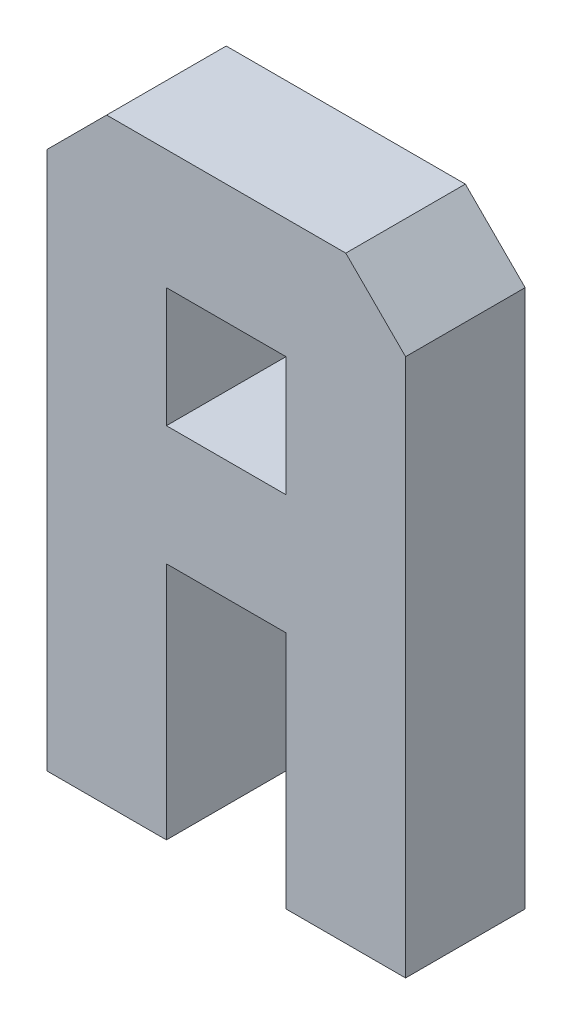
ISO-10303-21;
HEADER;
FILE_DESCRIPTION(('STEP AP214'),'2;1');
FILE_NAME('part.step','',(''),(''),'','','');
FILE_SCHEMA(('AUTOMOTIVE_DESIGN { 1 0 10303 214 1 1 1 1 }'));
ENDSEC;
DATA;
#1=APPLICATION_CONTEXT('core data for automotive mechanical design processes');
#2=APPLICATION_PROTOCOL_DEFINITION('international standard','automotive_design',2000,#1);
#3=PRODUCT_CONTEXT('',#1,'mechanical');
#4=PRODUCT('Part','Part','',(#3));
#5=PRODUCT_RELATED_PRODUCT_CATEGORY('part','',(#4));
#6=PRODUCT_DEFINITION_FORMATION('','',#4);
#7=PRODUCT_DEFINITION_CONTEXT('part definition',#1,'design');
#8=PRODUCT_DEFINITION('design','',#6,#7);
#9=PRODUCT_DEFINITION_SHAPE('','',#8);
#10=(LENGTH_UNIT() NAMED_UNIT(*) SI_UNIT(.MILLI.,.METRE.));
#11=(NAMED_UNIT(*) PLANE_ANGLE_UNIT() SI_UNIT($,.RADIAN.));
#12=(NAMED_UNIT(*) SI_UNIT($,.STERADIAN.) SOLID_ANGLE_UNIT());
#13=UNCERTAINTY_MEASURE_WITH_UNIT(LENGTH_MEASURE(1.E-05),#10,'distance_accuracy_value','');
#14=(GEOMETRIC_REPRESENTATION_CONTEXT(3) GLOBAL_UNCERTAINTY_ASSIGNED_CONTEXT((#13)) GLOBAL_UNIT_ASSIGNED_CONTEXT((#10,
#11,#12)) REPRESENTATION_CONTEXT('',''));
#15=CARTESIAN_POINT('',(0.,0.,0.));
#16=DIRECTION('',(0.,0.,1.));
#17=DIRECTION('',(1.,0.,0.));
#18=AXIS2_PLACEMENT_3D('',#15,#16,#17);
#19=CARTESIAN_POINT('',(0.,0.,10.));
#20=DIRECTION('',(0.,0.,-1.));
#21=DIRECTION('',(-1.,0.,0.));
#22=AXIS2_PLACEMENT_3D('',#19,#20,#21);
#23=PLANE('',#22);
#24=DIRECTION('',(-1.,0.,0.));
#25=VECTOR('',#24,1.);
#26=CARTESIAN_POINT('',(0.,50.,10.));
#27=LINE('',#26,#25);
#28=CARTESIAN_POINT('',(25.,50.,10.));
#29=VERTEX_POINT('',#28);
#30=CARTESIAN_POINT('',(5.00000000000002,50.,10.));
#31=VERTEX_POINT('',#30);
#32=EDGE_CURVE('E192',#29,#31,#27,.T.);
#33=ORIENTED_EDGE('',*,*,#32,.T.);
#34=DIRECTION('',(0.707106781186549,0.707106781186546,0.));
#35=VECTOR('',#34,1.);
#36=CARTESIAN_POINT('',(0.,45.,10.));
#37=LINE('',#36,#35);
#38=CARTESIAN_POINT('',(0.,45.,10.));
#39=VERTEX_POINT('',#38);
#40=EDGE_CURVE('E41',#31,#39,#37,.F.);
#41=ORIENTED_EDGE('',*,*,#40,.T.);
#42=DIRECTION('',(0.,-1.,0.));
#43=VECTOR('',#42,1.);
#44=CARTESIAN_POINT('',(0.,0.,10.));
#45=LINE('',#44,#43);
#46=CARTESIAN_POINT('',(0.,0.,10.));
#47=VERTEX_POINT('',#46);
#48=EDGE_CURVE('E194',#39,#47,#45,.T.);
#49=ORIENTED_EDGE('',*,*,#48,.T.);
#50=DIRECTION('',(1.,0.,0.));
#51=VECTOR('',#50,1.);
#52=CARTESIAN_POINT('',(10.,0.,10.));
#53=LINE('',#52,#51);
#54=CARTESIAN_POINT('',(10.,0.,10.));
#55=VERTEX_POINT('',#54);
#56=EDGE_CURVE('E178',#47,#55,#53,.T.);
#57=ORIENTED_EDGE('',*,*,#56,.T.);
#58=DIRECTION('',(0.,1.,0.));
#59=VECTOR('',#58,1.);
#60=CARTESIAN_POINT('',(10.,20.,10.));
#61=LINE('',#60,#59);
#62=CARTESIAN_POINT('',(10.,20.,10.));
#63=VERTEX_POINT('',#62);
#64=EDGE_CURVE('E181',#55,#63,#61,.T.);
#65=ORIENTED_EDGE('',*,*,#64,.T.);
#66=DIRECTION('',(1.,0.,0.));
#67=VECTOR('',#66,1.);
#68=CARTESIAN_POINT('',(20.,20.,10.));
#69=LINE('',#68,#67);
#70=CARTESIAN_POINT('',(20.,20.,10.));
#71=VERTEX_POINT('',#70);
#72=EDGE_CURVE('E184',#63,#71,#69,.T.);
#73=ORIENTED_EDGE('',*,*,#72,.T.);
#74=DIRECTION('',(0.,-1.,0.));
#75=VECTOR('',#74,1.);
#76=CARTESIAN_POINT('',(20.,0.,10.));
#77=LINE('',#76,#75);
#78=CARTESIAN_POINT('',(20.,0.,10.));
#79=VERTEX_POINT('',#78);
#80=EDGE_CURVE('E186',#71,#79,#77,.T.);
#81=ORIENTED_EDGE('',*,*,#80,.T.);
#82=DIRECTION('',(1.,0.,0.));
#83=VECTOR('',#82,1.);
#84=CARTESIAN_POINT('',(30.,0.,10.));
#85=LINE('',#84,#83);
#86=CARTESIAN_POINT('',(30.,0.,10.));
#87=VERTEX_POINT('',#86);
#88=EDGE_CURVE('E188',#79,#87,#85,.T.);
#89=ORIENTED_EDGE('',*,*,#88,.T.);
#90=DIRECTION('',(0.,1.,0.));
#91=VECTOR('',#90,1.);
#92=CARTESIAN_POINT('',(30.,50.,10.));
#93=LINE('',#92,#91);
#94=CARTESIAN_POINT('',(30.,45.,10.));
#95=VERTEX_POINT('',#94);
#96=EDGE_CURVE('E190',#87,#95,#93,.T.);
#97=ORIENTED_EDGE('',*,*,#96,.T.);
#98=DIRECTION('',(0.707106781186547,-0.707106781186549,0.));
#99=VECTOR('',#98,1.);
#100=CARTESIAN_POINT('',(25.,50.,10.));
#101=LINE('',#100,#99);
#102=EDGE_CURVE('E240',#95,#29,#101,.F.);
#103=ORIENTED_EDGE('',*,*,#102,.T.);
#104=EDGE_LOOP('',(#33,#41,#49,#57,#65,#73,#81,#89,#97,#103));
#105=FACE_BOUND('',#104,.T.);
#106=DIRECTION('',(0.,-1.,0.));
#107=VECTOR('',#106,1.);
#108=CARTESIAN_POINT('',(10.,40.,10.));
#109=LINE('',#108,#107);
#110=CARTESIAN_POINT('',(10.,40.,10.));
#111=VERTEX_POINT('',#110);
#112=CARTESIAN_POINT('',(10.,30.,10.));
#113=VERTEX_POINT('',#112);
#114=EDGE_CURVE('E137',#111,#113,#109,.T.);
#115=ORIENTED_EDGE('',*,*,#114,.F.);
#116=DIRECTION('',(-1.,0.,0.));
#117=VECTOR('',#116,1.);
#118=CARTESIAN_POINT('',(10.,40.,10.));
#119=LINE('',#118,#117);
#120=CARTESIAN_POINT('',(20.,40.,10.));
#121=VERTEX_POINT('',#120);
#122=EDGE_CURVE('E162',#121,#111,#119,.T.);
#123=ORIENTED_EDGE('',*,*,#122,.F.);
#124=DIRECTION('',(0.,1.,0.));
#125=VECTOR('',#124,1.);
#126=CARTESIAN_POINT('',(20.,40.,10.));
#127=LINE('',#126,#125);
#128=CARTESIAN_POINT('',(20.,30.,10.));
#129=VERTEX_POINT('',#128);
#130=EDGE_CURVE('E160',#129,#121,#127,.T.);
#131=ORIENTED_EDGE('',*,*,#130,.F.);
#132=DIRECTION('',(1.,0.,0.));
#133=VECTOR('',#132,1.);
#134=CARTESIAN_POINT('',(10.,30.,10.));
#135=LINE('',#134,#133);
#136=EDGE_CURVE('E147',#113,#129,#135,.T.);
#137=ORIENTED_EDGE('',*,*,#136,.F.);
#138=EDGE_LOOP('',(#115,#123,#131,#137));
#139=FACE_BOUND('',#138,.T.);
#140=ADVANCED_FACE('F33',(#105,#139),#23,.F.);
#141=CARTESIAN_POINT('',(0.,0.,0.));
#142=DIRECTION('',(0.,0.,-1.));
#143=DIRECTION('',(-1.,0.,0.));
#144=AXIS2_PLACEMENT_3D('',#141,#142,#143);
#145=PLANE('',#144);
#146=DIRECTION('',(0.,-1.,0.));
#147=VECTOR('',#146,1.);
#148=CARTESIAN_POINT('',(0.,0.,0.));
#149=LINE('',#148,#147);
#150=CARTESIAN_POINT('',(0.,45.,0.));
#151=VERTEX_POINT('',#150);
#152=CARTESIAN_POINT('',(0.,0.,0.));
#153=VERTEX_POINT('',#152);
#154=EDGE_CURVE('E182',#151,#153,#149,.T.);
#155=ORIENTED_EDGE('',*,*,#154,.F.);
#156=DIRECTION('',(-0.707106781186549,-0.707106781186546,0.));
#157=VECTOR('',#156,1.);
#158=CARTESIAN_POINT('',(-22.5,22.5000000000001,0.));
#159=LINE('',#158,#157);
#160=CARTESIAN_POINT('',(5.00000000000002,50.,0.));
#161=VERTEX_POINT('',#160);
#162=EDGE_CURVE('E234',#151,#161,#159,.F.);
#163=ORIENTED_EDGE('',*,*,#162,.T.);
#164=DIRECTION('',(-1.,0.,0.));
#165=VECTOR('',#164,1.);
#166=CARTESIAN_POINT('',(0.,50.,0.));
#167=LINE('',#166,#165);
#168=CARTESIAN_POINT('',(25.,50.,0.));
#169=VERTEX_POINT('',#168);
#170=EDGE_CURVE('E209',#169,#161,#167,.T.);
#171=ORIENTED_EDGE('',*,*,#170,.F.);
#172=DIRECTION('',(-0.707106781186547,0.707106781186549,0.));
#173=VECTOR('',#172,1.);
#174=CARTESIAN_POINT('',(37.5,37.4999999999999,0.));
#175=LINE('',#174,#173);
#176=CARTESIAN_POINT('',(30.,45.,0.));
#177=VERTEX_POINT('',#176);
#178=EDGE_CURVE('E232',#169,#177,#175,.F.);
#179=ORIENTED_EDGE('',*,*,#178,.T.);
#180=DIRECTION('',(0.,1.,0.));
#181=VECTOR('',#180,1.);
#182=CARTESIAN_POINT('',(30.,50.,0.));
#183=LINE('',#182,#181);
#184=CARTESIAN_POINT('',(30.,0.,0.));
#185=VERTEX_POINT('',#184);
#186=EDGE_CURVE('E207',#185,#177,#183,.T.);
#187=ORIENTED_EDGE('',*,*,#186,.F.);
#188=DIRECTION('',(1.,0.,0.));
#189=VECTOR('',#188,1.);
#190=CARTESIAN_POINT('',(30.,0.,0.));
#191=LINE('',#190,#189);
#192=CARTESIAN_POINT('',(20.,0.,0.));
#193=VERTEX_POINT('',#192);
#194=EDGE_CURVE('E205',#193,#185,#191,.T.);
#195=ORIENTED_EDGE('',*,*,#194,.F.);
#196=DIRECTION('',(0.,-1.,0.));
#197=VECTOR('',#196,1.);
#198=CARTESIAN_POINT('',(20.,0.,0.));
#199=LINE('',#198,#197);
#200=CARTESIAN_POINT('',(20.,20.,0.));
#201=VERTEX_POINT('',#200);
#202=EDGE_CURVE('E203',#201,#193,#199,.T.);
#203=ORIENTED_EDGE('',*,*,#202,.F.);
#204=DIRECTION('',(1.,0.,0.));
#205=VECTOR('',#204,1.);
#206=CARTESIAN_POINT('',(20.,20.,0.));
#207=LINE('',#206,#205);
#208=CARTESIAN_POINT('',(10.,20.,0.));
#209=VERTEX_POINT('',#208);
#210=EDGE_CURVE('E201',#209,#201,#207,.T.);
#211=ORIENTED_EDGE('',*,*,#210,.F.);
#212=DIRECTION('',(0.,1.,0.));
#213=VECTOR('',#212,1.);
#214=CARTESIAN_POINT('',(10.,20.,0.));
#215=LINE('',#214,#213);
#216=CARTESIAN_POINT('',(10.,0.,0.));
#217=VERTEX_POINT('',#216);
#218=EDGE_CURVE('E199',#217,#209,#215,.T.);
#219=ORIENTED_EDGE('',*,*,#218,.F.);
#220=DIRECTION('',(1.,0.,0.));
#221=VECTOR('',#220,1.);
#222=CARTESIAN_POINT('',(10.,0.,0.));
#223=LINE('',#222,#221);
#224=EDGE_CURVE('E155',#153,#217,#223,.T.);
#225=ORIENTED_EDGE('',*,*,#224,.F.);
#226=EDGE_LOOP('',(#155,#163,#171,#179,#187,#195,#203,#211,#219,#225));
#227=FACE_BOUND('',#226,.T.);
#228=DIRECTION('',(-1.,0.,0.));
#229=VECTOR('',#228,1.);
#230=CARTESIAN_POINT('',(10.,40.,0.));
#231=LINE('',#230,#229);
#232=CARTESIAN_POINT('',(20.,40.,0.));
#233=VERTEX_POINT('',#232);
#234=CARTESIAN_POINT('',(10.,40.,0.));
#235=VERTEX_POINT('',#234);
#236=EDGE_CURVE('E148',#233,#235,#231,.T.);
#237=ORIENTED_EDGE('',*,*,#236,.T.);
#238=DIRECTION('',(0.,-1.,0.));
#239=VECTOR('',#238,1.);
#240=CARTESIAN_POINT('',(10.,40.,0.));
#241=LINE('',#240,#239);
#242=CARTESIAN_POINT('',(10.,30.,0.));
#243=VERTEX_POINT('',#242);
#244=EDGE_CURVE('E166',#235,#243,#241,.T.);
#245=ORIENTED_EDGE('',*,*,#244,.T.);
#246=DIRECTION('',(1.,0.,0.));
#247=VECTOR('',#246,1.);
#248=CARTESIAN_POINT('',(10.,30.,0.));
#249=LINE('',#248,#247);
#250=CARTESIAN_POINT('',(20.,30.,0.));
#251=VERTEX_POINT('',#250);
#252=EDGE_CURVE('E154',#243,#251,#249,.T.);
#253=ORIENTED_EDGE('',*,*,#252,.T.);
#254=DIRECTION('',(0.,1.,0.));
#255=VECTOR('',#254,1.);
#256=CARTESIAN_POINT('',(20.,40.,0.));
#257=LINE('',#256,#255);
#258=EDGE_CURVE('E169',#251,#233,#257,.T.);
#259=ORIENTED_EDGE('',*,*,#258,.T.);
#260=EDGE_LOOP('',(#237,#245,#253,#259));
#261=FACE_BOUND('',#260,.T.);
#262=ADVANCED_FACE('F254',(#227,#261),#145,.T.);
#263=CARTESIAN_POINT('',(10.,0.,10.));
#264=DIRECTION('',(0.,1.,0.));
#265=DIRECTION('',(0.,0.,1.));
#266=AXIS2_PLACEMENT_3D('',#263,#264,#265);
#267=PLANE('',#266);
#268=ORIENTED_EDGE('',*,*,#224,.T.);
#269=DIRECTION('',(0.,0.,-1.));
#270=VECTOR('',#269,1.);
#271=CARTESIAN_POINT('',(10.,0.,10.));
#272=LINE('',#271,#270);
#273=EDGE_CURVE('E226',#55,#217,#272,.T.);
#274=ORIENTED_EDGE('',*,*,#273,.F.);
#275=ORIENTED_EDGE('',*,*,#56,.F.);
#276=DIRECTION('',(0.,0.,-1.));
#277=VECTOR('',#276,1.);
#278=CARTESIAN_POINT('',(0.,0.,10.));
#279=LINE('',#278,#277);
#280=EDGE_CURVE('E196',#47,#153,#279,.T.);
#281=ORIENTED_EDGE('',*,*,#280,.T.);
#282=EDGE_LOOP('',(#268,#274,#275,#281));
#283=FACE_BOUND('',#282,.T.);
#284=ADVANCED_FACE('F283',(#283),#267,.F.);
#285=CARTESIAN_POINT('',(10.,20.,10.));
#286=DIRECTION('',(-1.,0.,0.));
#287=DIRECTION('',(0.,-1.,0.));
#288=AXIS2_PLACEMENT_3D('',#285,#286,#287);
#289=PLANE('',#288);
#290=ORIENTED_EDGE('',*,*,#218,.T.);
#291=DIRECTION('',(0.,0.,-1.));
#292=VECTOR('',#291,1.);
#293=CARTESIAN_POINT('',(10.,20.,10.));
#294=LINE('',#293,#292);
#295=EDGE_CURVE('E223',#63,#209,#294,.T.);
#296=ORIENTED_EDGE('',*,*,#295,.F.);
#297=ORIENTED_EDGE('',*,*,#64,.F.);
#298=ORIENTED_EDGE('',*,*,#273,.T.);
#299=EDGE_LOOP('',(#290,#296,#297,#298));
#300=FACE_BOUND('',#299,.T.);
#301=ADVANCED_FACE('F280',(#300),#289,.F.);
#302=CARTESIAN_POINT('',(20.,20.,10.));
#303=DIRECTION('',(0.,1.,0.));
#304=DIRECTION('',(-1.,0.,0.));
#305=AXIS2_PLACEMENT_3D('',#302,#303,#304);
#306=PLANE('',#305);
#307=ORIENTED_EDGE('',*,*,#210,.T.);
#308=DIRECTION('',(0.,0.,-1.));
#309=VECTOR('',#308,1.);
#310=CARTESIAN_POINT('',(20.,20.,10.));
#311=LINE('',#310,#309);
#312=EDGE_CURVE('E220',#71,#201,#311,.T.);
#313=ORIENTED_EDGE('',*,*,#312,.F.);
#314=ORIENTED_EDGE('',*,*,#72,.F.);
#315=ORIENTED_EDGE('',*,*,#295,.T.);
#316=EDGE_LOOP('',(#307,#313,#314,#315));
#317=FACE_BOUND('',#316,.T.);
#318=ADVANCED_FACE('F277',(#317),#306,.F.);
#319=CARTESIAN_POINT('',(20.,0.,10.));
#320=DIRECTION('',(1.,0.,0.));
#321=DIRECTION('',(0.,0.,-1.));
#322=AXIS2_PLACEMENT_3D('',#319,#320,#321);
#323=PLANE('',#322);
#324=ORIENTED_EDGE('',*,*,#202,.T.);
#325=DIRECTION('',(0.,0.,-1.));
#326=VECTOR('',#325,1.);
#327=CARTESIAN_POINT('',(20.,0.,10.));
#328=LINE('',#327,#326);
#329=EDGE_CURVE('E217',#79,#193,#328,.T.);
#330=ORIENTED_EDGE('',*,*,#329,.F.);
#331=ORIENTED_EDGE('',*,*,#80,.F.);
#332=ORIENTED_EDGE('',*,*,#312,.T.);
#333=EDGE_LOOP('',(#324,#330,#331,#332));
#334=FACE_BOUND('',#333,.T.);
#335=ADVANCED_FACE('F272',(#334),#323,.F.);
#336=CARTESIAN_POINT('',(30.,0.,10.));
#337=DIRECTION('',(0.,1.,0.));
#338=DIRECTION('',(-1.,0.,0.));
#339=AXIS2_PLACEMENT_3D('',#336,#337,#338);
#340=PLANE('',#339);
#341=ORIENTED_EDGE('',*,*,#194,.T.);
#342=DIRECTION('',(0.,0.,-1.));
#343=VECTOR('',#342,1.);
#344=CARTESIAN_POINT('',(30.,0.,10.));
#345=LINE('',#344,#343);
#346=EDGE_CURVE('E214',#87,#185,#345,.T.);
#347=ORIENTED_EDGE('',*,*,#346,.F.);
#348=ORIENTED_EDGE('',*,*,#88,.F.);
#349=ORIENTED_EDGE('',*,*,#329,.T.);
#350=EDGE_LOOP('',(#341,#347,#348,#349));
#351=FACE_BOUND('',#350,.T.);
#352=ADVANCED_FACE('F267',(#351),#340,.F.);
#353=CARTESIAN_POINT('',(30.,50.,10.));
#354=DIRECTION('',(-1.,0.,0.));
#355=DIRECTION('',(0.,-1.,0.));
#356=AXIS2_PLACEMENT_3D('',#353,#354,#355);
#357=PLANE('',#356);
#358=ORIENTED_EDGE('',*,*,#186,.T.);
#359=DIRECTION('',(0.,0.,1.));
#360=VECTOR('',#359,1.);
#361=CARTESIAN_POINT('',(30.,45.,10.));
#362=LINE('',#361,#360);
#363=EDGE_CURVE('E11',#177,#95,#362,.T.);
#364=ORIENTED_EDGE('',*,*,#363,.T.);
#365=ORIENTED_EDGE('',*,*,#96,.F.);
#366=ORIENTED_EDGE('',*,*,#346,.T.);
#367=EDGE_LOOP('',(#358,#364,#365,#366));
#368=FACE_BOUND('',#367,.T.);
#369=ADVANCED_FACE('F263',(#368),#357,.F.);
#370=CARTESIAN_POINT('',(0.,50.,10.));
#371=DIRECTION('',(0.,-1.,0.));
#372=DIRECTION('',(0.,0.,-1.));
#373=AXIS2_PLACEMENT_3D('',#370,#371,#372);
#374=PLANE('',#373);
#375=ORIENTED_EDGE('',*,*,#170,.T.);
#376=DIRECTION('',(0.,0.,1.));
#377=VECTOR('',#376,1.);
#378=CARTESIAN_POINT('',(5.00000000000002,50.,10.));
#379=LINE('',#378,#377);
#380=EDGE_CURVE('E54',#161,#31,#379,.T.);
#381=ORIENTED_EDGE('',*,*,#380,.T.);
#382=ORIENTED_EDGE('',*,*,#32,.F.);
#383=DIRECTION('',(0.,0.,-1.));
#384=VECTOR('',#383,1.);
#385=CARTESIAN_POINT('',(25.,50.,10.));
#386=LINE('',#385,#384);
#387=EDGE_CURVE('E236',#29,#169,#386,.T.);
#388=ORIENTED_EDGE('',*,*,#387,.T.);
#389=EDGE_LOOP('',(#375,#381,#382,#388));
#390=FACE_BOUND('',#389,.T.);
#391=ADVANCED_FACE('F257',(#390),#374,.F.);
#392=CARTESIAN_POINT('',(0.,0.,10.));
#393=DIRECTION('',(1.,0.,0.));
#394=DIRECTION('',(0.,0.,-1.));
#395=AXIS2_PLACEMENT_3D('',#392,#393,#394);
#396=PLANE('',#395);
#397=ORIENTED_EDGE('',*,*,#48,.F.);
#398=DIRECTION('',(0.,0.,-1.));
#399=VECTOR('',#398,1.);
#400=CARTESIAN_POINT('',(0.,45.,10.));
#401=LINE('',#400,#399);
#402=EDGE_CURVE('E229',#39,#151,#401,.T.);
#403=ORIENTED_EDGE('',*,*,#402,.T.);
#404=ORIENTED_EDGE('',*,*,#154,.T.);
#405=ORIENTED_EDGE('',*,*,#280,.F.);
#406=EDGE_LOOP('',(#397,#403,#404,#405));
#407=FACE_BOUND('',#406,.T.);
#408=ADVANCED_FACE('F248',(#407),#396,.F.);
#409=CARTESIAN_POINT('',(10.,40.,10.));
#410=DIRECTION('',(1.,0.,0.));
#411=DIRECTION('',(0.,0.,-1.));
#412=AXIS2_PLACEMENT_3D('',#409,#410,#411);
#413=PLANE('',#412);
#414=ORIENTED_EDGE('',*,*,#244,.F.);
#415=DIRECTION('',(0.,0.,-1.));
#416=VECTOR('',#415,1.);
#417=CARTESIAN_POINT('',(10.,40.,10.));
#418=LINE('',#417,#416);
#419=EDGE_CURVE('E143',#111,#235,#418,.T.);
#420=ORIENTED_EDGE('',*,*,#419,.F.);
#421=ORIENTED_EDGE('',*,*,#114,.T.);
#422=DIRECTION('',(0.,0.,-1.));
#423=VECTOR('',#422,1.);
#424=CARTESIAN_POINT('',(10.,30.,10.));
#425=LINE('',#424,#423);
#426=EDGE_CURVE('E140',#113,#243,#425,.T.);
#427=ORIENTED_EDGE('',*,*,#426,.T.);
#428=EDGE_LOOP('',(#414,#420,#421,#427));
#429=FACE_BOUND('',#428,.T.);
#430=ADVANCED_FACE('F139',(#429),#413,.T.);
#431=CARTESIAN_POINT('',(10.,30.,10.));
#432=DIRECTION('',(0.,1.,0.));
#433=DIRECTION('',(0.,0.,1.));
#434=AXIS2_PLACEMENT_3D('',#431,#432,#433);
#435=PLANE('',#434);
#436=ORIENTED_EDGE('',*,*,#252,.F.);
#437=ORIENTED_EDGE('',*,*,#426,.F.);
#438=ORIENTED_EDGE('',*,*,#136,.T.);
#439=DIRECTION('',(0.,0.,-1.));
#440=VECTOR('',#439,1.);
#441=CARTESIAN_POINT('',(20.,30.,10.));
#442=LINE('',#441,#440);
#443=EDGE_CURVE('E156',#129,#251,#442,.T.);
#444=ORIENTED_EDGE('',*,*,#443,.T.);
#445=EDGE_LOOP('',(#436,#437,#438,#444));
#446=FACE_BOUND('',#445,.T.);
#447=ADVANCED_FACE('F151',(#446),#435,.T.);
#448=CARTESIAN_POINT('',(20.,40.,10.));
#449=DIRECTION('',(-1.,0.,0.));
#450=DIRECTION('',(0.,0.,1.));
#451=AXIS2_PLACEMENT_3D('',#448,#449,#450);
#452=PLANE('',#451);
#453=ORIENTED_EDGE('',*,*,#258,.F.);
#454=ORIENTED_EDGE('',*,*,#443,.F.);
#455=ORIENTED_EDGE('',*,*,#130,.T.);
#456=DIRECTION('',(0.,0.,-1.));
#457=VECTOR('',#456,1.);
#458=CARTESIAN_POINT('',(20.,40.,10.));
#459=LINE('',#458,#457);
#460=EDGE_CURVE('E175',#121,#233,#459,.T.);
#461=ORIENTED_EDGE('',*,*,#460,.T.);
#462=EDGE_LOOP('',(#453,#454,#455,#461));
#463=FACE_BOUND('',#462,.T.);
#464=ADVANCED_FACE('F347',(#463),#452,.T.);
#465=CARTESIAN_POINT('',(10.,40.,10.));
#466=DIRECTION('',(0.,-1.,0.));
#467=DIRECTION('',(0.,0.,-1.));
#468=AXIS2_PLACEMENT_3D('',#465,#466,#467);
#469=PLANE('',#468);
#470=ORIENTED_EDGE('',*,*,#236,.F.);
#471=ORIENTED_EDGE('',*,*,#460,.F.);
#472=ORIENTED_EDGE('',*,*,#122,.T.);
#473=ORIENTED_EDGE('',*,*,#419,.T.);
#474=EDGE_LOOP('',(#470,#471,#472,#473));
#475=FACE_BOUND('',#474,.T.);
#476=ADVANCED_FACE('F353',(#475),#469,.T.);
#477=CARTESIAN_POINT('',(0.,45.,10.));
#478=DIRECTION('',(0.707106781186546,-0.707106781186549,0.));
#479=DIRECTION('',(0.,0.,-1.));
#480=AXIS2_PLACEMENT_3D('',#477,#478,#479);
#481=PLANE('',#480);
#482=ORIENTED_EDGE('',*,*,#40,.F.);
#483=ORIENTED_EDGE('',*,*,#380,.F.);
#484=ORIENTED_EDGE('',*,*,#162,.F.);
#485=ORIENTED_EDGE('',*,*,#402,.F.);
#486=EDGE_LOOP('',(#482,#483,#484,#485));
#487=FACE_BOUND('',#486,.T.);
#488=ADVANCED_FACE('F251',(#487),#481,.F.);
#489=CARTESIAN_POINT('',(25.,50.,10.));
#490=DIRECTION('',(-0.707106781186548,-0.707106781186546,0.));
#491=DIRECTION('',(0.,0.,-1.));
#492=AXIS2_PLACEMENT_3D('',#489,#490,#491);
#493=PLANE('',#492);
#494=ORIENTED_EDGE('',*,*,#102,.F.);
#495=ORIENTED_EDGE('',*,*,#363,.F.);
#496=ORIENTED_EDGE('',*,*,#178,.F.);
#497=ORIENTED_EDGE('',*,*,#387,.F.);
#498=EDGE_LOOP('',(#494,#495,#496,#497));
#499=FACE_BOUND('',#498,.T.);
#500=ADVANCED_FACE('F35',(#499),#493,.F.);
#501=CLOSED_SHELL('',(#140,#262,#284,#301,#318,#335,#352,#369,#391,#408,#430,#447,#464,#476,
#488,#500));
#502=MANIFOLD_SOLID_BREP('B2',#501);
#503=ADVANCED_BREP_SHAPE_REPRESENTATION('',(#18,#502),#14);
#504=SHAPE_DEFINITION_REPRESENTATION(#9,#503);
ENDSEC;
END-ISO-10303-21;
